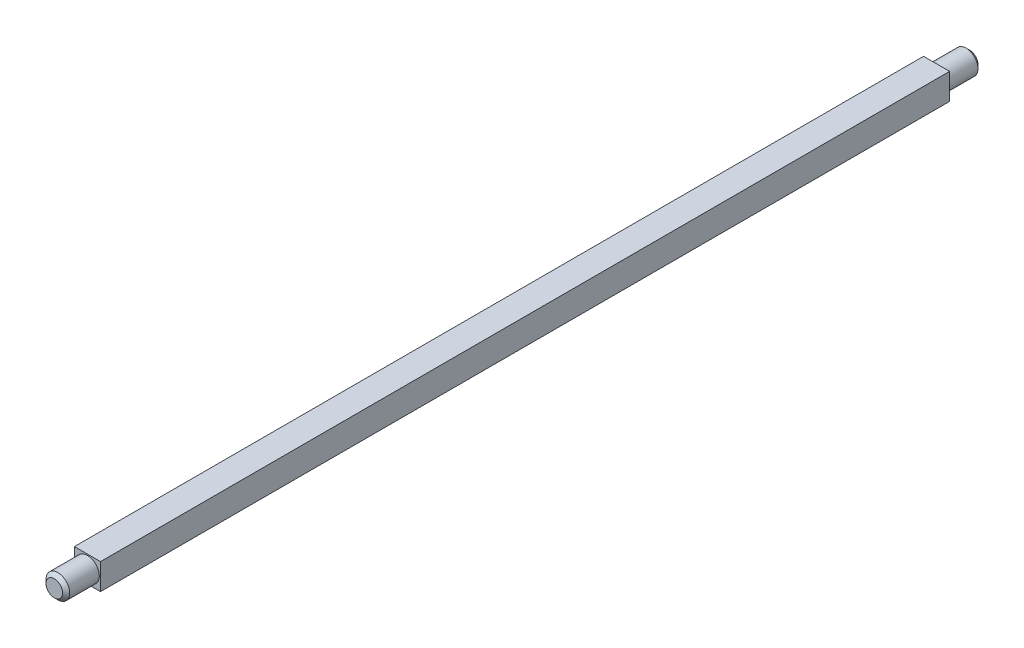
from build123d import *

# Parameters (mm, degrees)
BOSS_EXTRU_1_DEPTH      = 179.25
BOSS_EXTRU_1_DEPTH_BACK = 179.25
ESQUISSE1_W             = 11
ESQUISSE1_H             = 11
ESQUISSE2_R             = 5
BOSS_EXTRU_2_DEPTH      = 14
CHANFREIN1_SIZE         = 1.5
CHANFREIN2_SIZE         = 1.5


with BuildPart() as part:
    # Esquisse1 → Boss.-Extru.1 (new, two sides: drawn at the far end of the back side and taken through both)
    with BuildSketch(Plane.XY.offset(-BOSS_EXTRU_1_DEPTH_BACK)):
        Rectangle(ESQUISSE1_W, ESQUISSE1_H)
    extrude(amount=BOSS_EXTRU_1_DEPTH + BOSS_EXTRU_1_DEPTH_BACK)

    # Esquisse2 → Boss.-Extru.2 (add)
    with BuildSketch(Plane.XY.offset(179.25)):
        with Locations(Location((0, 0, 0), (0, 0, 180))):
            Circle(ESQUISSE2_R)
    boss_extru_2 = extrude(amount=BOSS_EXTRU_2_DEPTH)

    # Chanfrein1
    chanfrein1_edges = [part.edges().sort_by_distance(p)[0] for p in [
        (5, 0, 193.25),
    ]]
    chamfer(chanfrein1_edges, length=CHANFREIN1_SIZE)

    # Sym_trie13: Boss.-Extru.2 across plane
    add(boss_extru_2.mirror(Plane.XY))

    # Chanfrein2
    chanfrein2_edges = [part.edges().sort_by_distance(p)[0] for p in [
        (5, 0, -193.25),
    ]]
    chamfer(chanfrein2_edges, length=CHANFREIN2_SIZE)


solid = part.part
